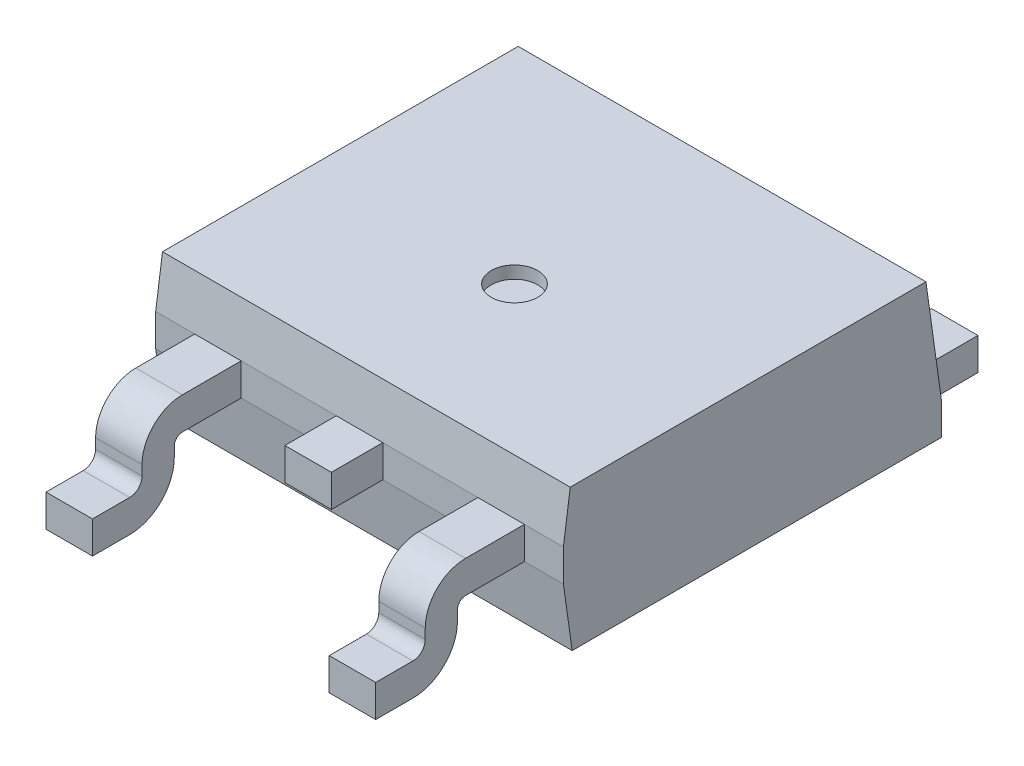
from build123d import *

# Parameters (mm, degrees)
BOX_DEPTH          = 6.58
SKETCH2_W          = 5.36
SKETCH2_H          = 4.32
CUT_EXTRUDE1_DEPTH = 0.52
EXTRUDE2_DEPTH     = 0.52
SKETCH4_W          = 0.75
SKETCH4_H          = 0.52
SKETCH6_W          = 0.75
SKETCH6_H          = 0.52
EXTRUDE3_DEPTH     = 0.83
SKETCH7_R          = 0.375
CUT_EXTRUDE2_DEPTH = 0.2


with BuildPart() as part:
    # Sketch1 → BOX (new body)
    with BuildSketch(Plane(origin=(0, 0, 0), x_dir=(0, 0, -1), z_dir=(1, 0, 0))):
        Polygon((0, 1), (0, 1.52), (0.109621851, 2.3), (5.849837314, 2.3), (6.1, 0.52), (6.1, 0), (0.140540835, 0), align=None)
    extrude(amount=BOX_DEPTH)

    # Sketch2 → Cut-Extrude1 (cut)
    with BuildSketch(Plane.XZ):
        with Locations((3.29, -3.94)):
            Rectangle(SKETCH2_W, SKETCH2_H)
    extrude(amount=-CUT_EXTRUDE1_DEPTH, mode=Mode.SUBTRACT)

    # Sweep1: sweep along a path in Sketch5
    with BuildLine(Plane(origin=(6.58, 0, 0), x_dir=(0, 0, -1), z_dir=(1, 0, 0))) as sweep1_path:
        Line((-2.4, 0.511), (-1.8, 0.511))
        ThreePointArc((-1.8, 0.511), (-1.658578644, 0.569578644), (-1.6, 0.711))
        Line((-1.6, 0.711), (-1.6, 0.87))
        ThreePointArc((-1.6, 0.87), (-1.409619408, 1.329619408), (-0.95, 1.52))
        Line((-0.95, 1.52), (0, 1.52))
    # Sketch4 → Sweep1 (sweep)
    with BuildSketch(Plane.XY):
        with Locations((1.005, 1.26)):
            Rectangle(SKETCH4_W, SKETCH4_H)
        with Locations((5.575, 1.26)):
            Rectangle(SKETCH4_W, SKETCH4_H)
    sweep(path=sweep1_path.line)

    # Sketch6 → Extrude3 (add)
    with BuildSketch(Plane.XY):
        with Locations((3.29, 1.26)):
            Rectangle(SKETCH6_W, SKETCH6_H)
    extrude(amount=EXTRUDE3_DEPTH)

    # Sketch7 → Cut-Extrude2 (cut)
    with BuildSketch(Plane(origin=(0, 2.3, 0), x_dir=(1, 0, 0), z_dir=(0, 1, 0))):
        with Locations(Location((3.29, 2.5, 0), (0, 0, 270))):
            Circle(SKETCH7_R)
    extrude(amount=-CUT_EXTRUDE2_DEPTH, mode=Mode.SUBTRACT)


with BuildPart() as body_2:
    # Sketch3 → Extrude2 (new body)
    with BuildSketch(Plane.XZ.offset(-0.52)):
        Polygon((5.97, -7.3), (5.97, -5.7), (5.67, -5.7), (5.67, -5.35), (5.97, -5.35), (5.97, -1.78), (0.61, -1.78), (0.61, -5.35), (0.91, -5.35), (0.91, -5.7), (0.61, -5.7), (0.61, -7.3), (1.36, -7.3), (1.36, -6.8), (5.22, -6.8), (5.22, -7.3), align=None)
        with BuildLine():
            Line((1.86, -5.7), (4.72, -5.7))
            ThreePointArc((4.72, -5.7), (4.896776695, -5.773223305), (4.97, -5.95))
            Line((4.97, -5.95), (4.97, -6.05))
            ThreePointArc((4.97, -6.05), (4.896776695, -6.226776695), (4.72, -6.3))
            Line((4.72, -6.3), (1.86, -6.3))
            ThreePointArc((1.86, -6.3), (1.683223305, -6.226776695), (1.61, -6.05))
            Line((1.61, -6.05), (1.61, -5.95))
            ThreePointArc((1.61, -5.95), (1.683223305, -5.773223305), (1.86, -5.7))
        make_face(mode=Mode.SUBTRACT)
    extrude(amount=EXTRUDE2_DEPTH)


solid = Compound([part.part, body_2.part])
